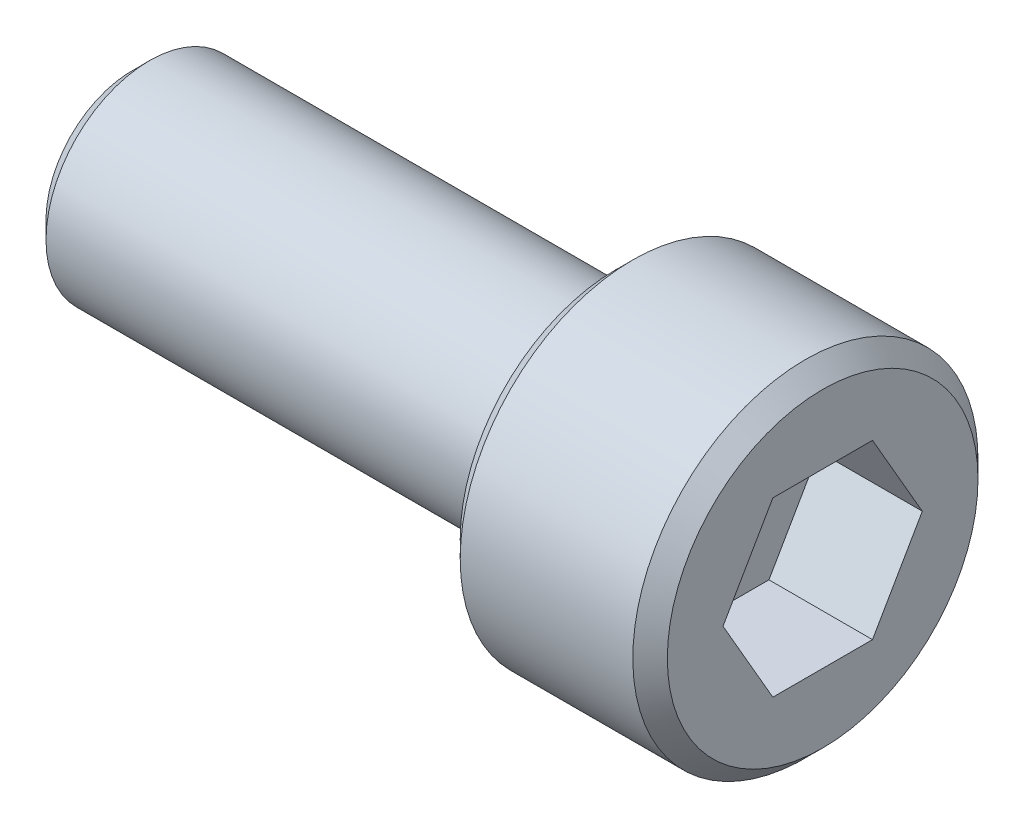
from build123d import *

# Parameters (mm, degrees)
ENL_V_MAT_EXTRU_1_DEPTH = 3
CHANFREIN2_SIZE         = 0.5


with BuildPart() as part:
    # Esquisse1 → R_volution1 (revolve)
    with BuildSketch(Plane.XY):
        Polygon((-20, 0), (-20, 3), (-6, 3), (-6, 5), (0, 5), (0, 0), align=None)
    revolve(axis=Axis((0, 0, 0), (-1, 0, 0)))

    # Esquisse2 → Enl_v. mat.-Extru.1 (cut)
    with BuildSketch(Plane(origin=(0, 0, 0), x_dir=(0, 0, -1), z_dir=(1, 0, 0))):
        Polygon((2.886751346, 0), (1.443375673, 2.5), (-1.443375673, 2.5), (-2.886751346, 0), (-1.443375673, -2.5), (1.443375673, -2.5), align=None)
    extrude(amount=-ENL_V_MAT_EXTRU_1_DEPTH, mode=Mode.SUBTRACT)

    # Chanfrein2
    chanfrein2_edges = [part.edges().sort_by_distance(p)[0] for p in [
        (0, -5, 0),
        (-6, -5, 0),
        (-20, -3, 0),
    ]]
    chamfer(chanfrein2_edges, length=CHANFREIN2_SIZE)


solid = part.part
